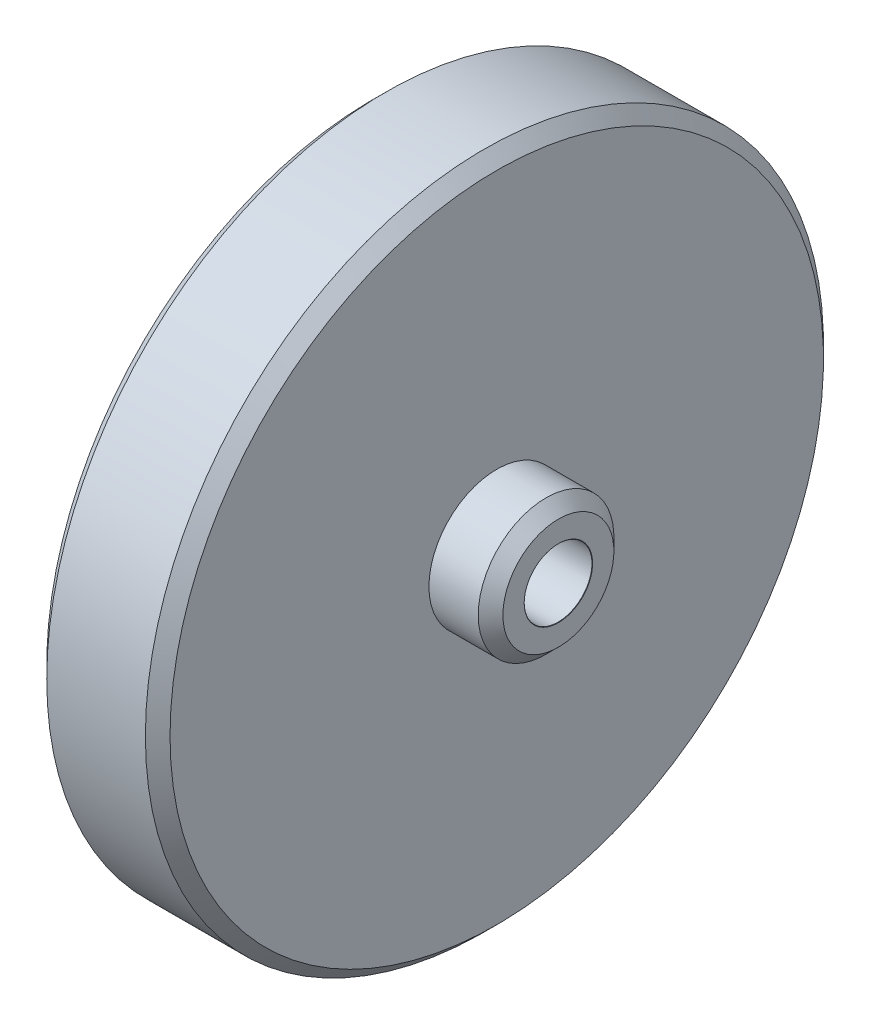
from build123d import *

# Parameters (mm, degrees)
CHANFREIN1_SIZE = 1


with BuildPart() as part:
    # Esquisse1 → R_volution1 (revolve)
    with BuildSketch(Plane.XY, mode=Mode.PRIVATE) as r_volution1_sk:
        Polygon((0, 5.5), (0, 27.5), (-10, 27.5), (-10, 0), (0, 0), (5, 0), (5, 4.5), (4, 5.5), align=None)
    revolve(r_volution1_sk.sketch.rotate(Axis((-10, 0, 0), (1, 0, 0)), 90), axis=Axis((-10, 0, 0), (1, 0, 0)))

    # Chanfrein1
    chanfrein1_edges = [part.edges().sort_by_distance(p)[0] for p in [
        (-10, 0, -27.5),
        (0, 0, -27.5),
    ]]
    chamfer(chanfrein1_edges, length=CHANFREIN1_SIZE)

    # Esquisse2 → Chambrage pour vis _ t_te hexagonale M51 (revolve, cut)
    with BuildSketch(Plane(origin=(-10, 0, 0), x_dir=(0, 0, 1), z_dir=(0, 1, 0))):
        Polygon((0, 0), (0, 15), (2.775, 15), (2.75, 14.975), (2.75, 5), (5, 5), (5, 0.025), (5.025, 0), align=None)
    revolve(axis=Axis((-16.35, 0, 0), (1, 0, 0)), mode=Mode.SUBTRACT)


solid = part.part
